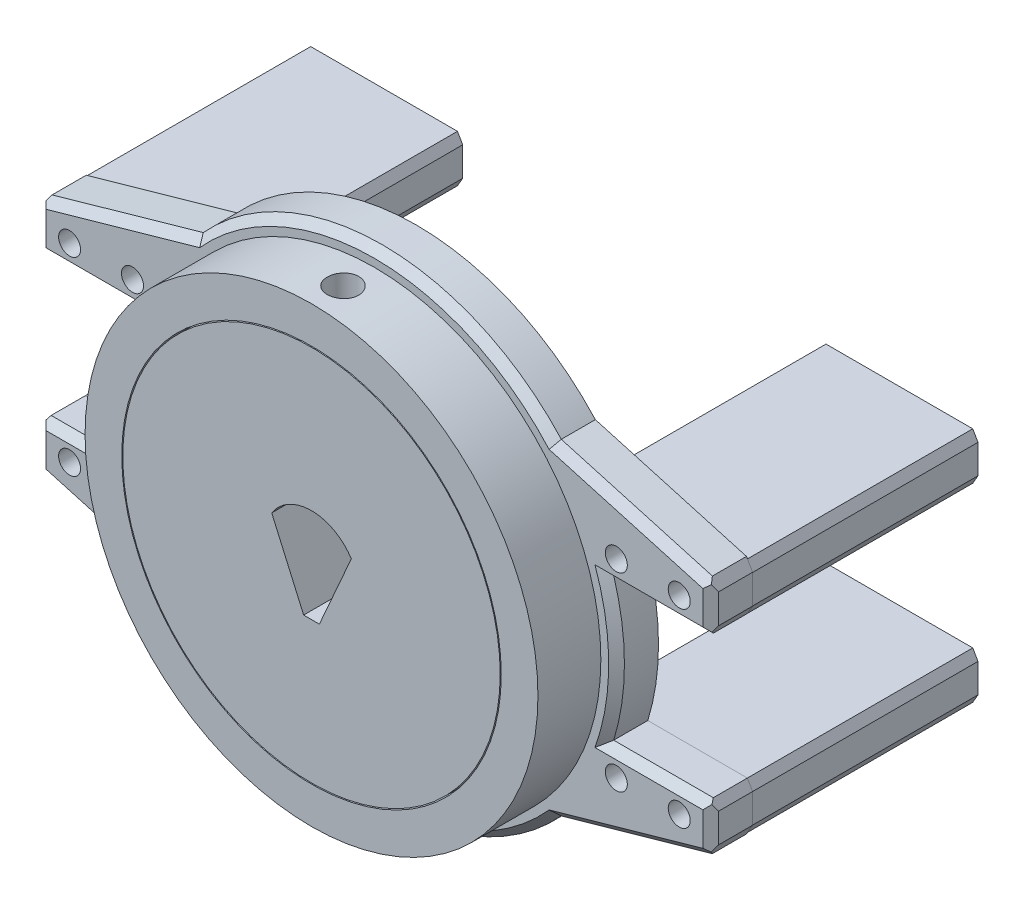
from build123d import *
from OCP.BRepFilletAPI import BRepFilletAPI_MakeChamfer
from build123d.topology import SkipClean

# Parameters (mm, degrees)
SKETCH2_R               = 36
BOSS_EXTRUDE1_DEPTH     = 12
CUT_EXTRUDE1_REACH      = 54.307
CUT_EXTRUDE1_END_RADIUS = 36
SKETCH3_R               = 2.6
SKETCH4_R               = 43.2
SKETCH4_R_2             = 36.2
BOSS_EXTRUDE2_DEPTH     = 12
CUT_EXTRUDE2_REACH      = 64.261
CUT_EXTRUDE2_END_RADIUS = 43.2
SKETCH5_R               = 3
SKETCH6_R               = 32
BOSS_EXTRUDE3_DEPTH     = 8
CHAMFER1_SIZE           = 1.5
BOSS_EXTRUDE4_DEPTH     = 43
BOSS_EXTRUDE4_2_DEPTH   = 43
BOSS_EXTRUDE4_3_DEPTH   = 43
BOSS_EXTRUDE4_4_DEPTH   = 43
CHAMFER3_SIZE           = 1
CHAMFER3_SIZE2          = 1.732050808
CHAMFER4_SIZE           = 1.7
CHAMFER4_SIZE2          = 1.220147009
CHAMFER4_SIZE2_2        = 0.981495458
CHAMFER5_SIZE           = 1.7
CHAMFER5_SIZE2          = 1.220147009
CHAMFER6_SIZE           = 1.7
CHAMFER6_SIZE2          = 1.220147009
SKETCH8_R               = 2.1
CUT_EXTRUDE3_DEPTH      = 8
SKETCH9_R               = 1.65
CUT_EXTRUDE4_DEPTH      = 25


with BuildPart() as part:
    # Sketch2 → Boss-Extrude1 (new body)
    with BuildSketch(Plane.XY):
        Circle(SKETCH2_R)
        with BuildLine():
            Line((-7.591902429, 4.833530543), (-1.5, -9))
            Line((-1.5, -9), (1.5, -9))
            Line((1.5, -9), (7.591902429, 4.833530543))
            ThreePointArc((7.591902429, 4.833530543), (4.330024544, 7.889923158), (0, 9))
            ThreePointArc((0, 9), (-4.330024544, 7.889923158), (-7.591902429, 4.833530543))
        make_face(mode=Mode.SUBTRACT)
    extrude(amount=BOSS_EXTRUDE1_DEPTH)

    # Cut-Extrude1: up to this cylinder (the profile starts inside it)
    with SkipClean():  # the faces are left unmerged after this step: merging them gives an invalid solid
        cut_extrude1_end = Plane(origin=(0, 0, 6), z_dir=(0, 0, -1)) * Cylinder(CUT_EXTRUDE1_END_RADIUS, 181.614, mode=Mode.PRIVATE)
        # Sketch3 → Cut-Extrude1 (cut, up to the surface)
        with BuildSketch(Plane(origin=(0, 0, 0), x_dir=(1, 0, 0), z_dir=(0, 1, 0)), mode=Mode.PRIVATE) as cut_extrude1_sk1:
            with Locations(Location((0, -6, 0), (0, 0, 90))):
                Circle(SKETCH3_R)
        cut_extrude1_tool1 = extrude(cut_extrude1_sk1.sketch, amount=CUT_EXTRUDE1_REACH, mode=Mode.PRIVATE) & cut_extrude1_end
        add(cut_extrude1_tool1.solids().sort_by_distance((0, 0, 6))[0], mode=Mode.SUBTRACT)


with BuildPart() as body_2:
    # Sketch4 → Boss-Extrude2 (new body)
    with BuildSketch(Plane(origin=(0, 0, 0), x_dir=(-1, 0, 0), z_dir=(0, 0, -1))):
        Circle(SKETCH4_R)
        Circle(SKETCH4_R_2, mode=Mode.SUBTRACT)
    extrude(amount=-BOSS_EXTRUDE2_DEPTH)

    # Cut-Extrude2: up to this cylinder (the profile starts inside it)
    cut_extrude2_end = Plane(origin=(0, 0, 6), z_dir=(0, 0, -1)) * Cylinder(CUT_EXTRUDE2_END_RADIUS, 215.922, mode=Mode.PRIVATE)
    # Sketch5 → Cut-Extrude2 (cut, up to the surface)
    with BuildSketch(Plane(origin=(0, 0, 0), x_dir=(1, 0, 0), z_dir=(0, 1, 0)), mode=Mode.PRIVATE) as cut_extrude2_sk1:
        with Locations(Location((0, -6, 0), (0, 0, 90))):
            Circle(SKETCH5_R)
    cut_extrude2_tool1 = extrude(cut_extrude2_sk1.sketch, amount=CUT_EXTRUDE2_REACH, mode=Mode.PRIVATE) & cut_extrude2_end
    add(cut_extrude2_tool1.solids().sort_by_distance((0, 0, 6))[0], mode=Mode.SUBTRACT)

    # Sketch6 → Boss-Extrude3 (add)
    with BuildSketch(Plane(origin=(0, 0, 0), x_dir=(-1, 0, 0), z_dir=(0, 0, -1))):
        with BuildLine():
            Line((44.152916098, -13.6), (64.152916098, -13.6))
            Line((64.152916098, -13.6), (64.152916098, -22.6))
            Line((64.152916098, -22.6), (34.152916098, -31.112992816))
            ThreePointArc((34.152916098, -31.112992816), (0, -46.2), (-34.152916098, -31.112992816))
            Line((-34.152916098, -31.112992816), (-64.152916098, -22.6))
            Line((-64.152916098, -22.6), (-64.152916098, -13.6))
            Line((-64.152916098, -13.6), (-44.152916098, -13.6))
            ThreePointArc((-44.152916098, -13.6), (-46.2, 0), (-44.152916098, 13.6))
            Line((-44.152916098, 13.6), (-64.152916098, 13.6))
            Line((-64.152916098, 13.6), (-64.152916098, 22.6))
            Line((-64.152916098, 22.6), (-34.152916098, 31.112992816))
            ThreePointArc((-34.152916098, 31.112992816), (0, 46.2), (34.152916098, 31.112992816))
            Line((34.152916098, 31.112992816), (64.152916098, 22.6))
            Line((64.152916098, 22.6), (64.152916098, 13.6))
            Line((64.152916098, 13.6), (44.152916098, 13.6))
            ThreePointArc((44.152916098, 13.6), (46.2, 0), (44.152916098, -13.6))
        make_face()
        Circle(SKETCH6_R, mode=Mode.SUBTRACT)
    extrude(amount=BOSS_EXTRUDE3_DEPTH)

    # Chamfer1
    chamfer1_edges = [body_2.edges().sort_by_distance(p)[0] for p in [
        (-64.152916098, 18.1, 0),
        (-49.152916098, 26.856496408, 0),
        (0, 46.2, 0),
        (49.152916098, 26.856496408, 0),
        (64.152916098, 18.1, 0),
        (54.152916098, 13.6, 0),
        (46.2, 0, 0),
        (54.152916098, -13.6, 0),
        (64.152916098, -18.1, 0),
        (49.152916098, -26.856496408, 0),
        (0, -46.2, 0),
        (-49.152916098, -26.856496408, 0),
        (-64.152916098, -18.1, 0),
        (-54.152916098, -13.6, 0),
        (-46.2, 0, 0),
        (-54.152916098, 13.6, 0),
    ]]
    chamfer(chamfer1_edges, length=CHAMFER1_SIZE)

    # Chamfer3: one chamfer whose edges measure the first distance from different faces: ONE call of the kernel's chamfer builder (chamfer() names one face for all edges)
    chamfer3_edges_1 = [body_2.edges().sort_by_distance(p)[0] for p in [
        (-64.152916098, 13.6, -4.75),
    ]]
    chamfer3_side_1 = [body_2.faces().sort_by_distance(p)[0] for p in [
        (-54.152916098, 13.6, -4.75),
    ]]
    chamfer3_edges_2 = [body_2.edges().sort_by_distance(p)[0] for p in [
        (64.152916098, -13.6, -4.75),
    ]]
    chamfer3_side_2 = [body_2.faces().sort_by_distance(p)[0] for p in [
        (54.152916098, -13.6, -4.75),
    ]]
    chamfer3 = BRepFilletAPI_MakeChamfer(body_2.part.solid().wrapped)
    for e in chamfer3_edges_1:
        chamfer3.Add(CHAMFER3_SIZE, CHAMFER3_SIZE2, e.wrapped, chamfer3_side_1[0].wrapped)  # the first distance lies on this face
    for e in chamfer3_edges_2:
        chamfer3.Add(CHAMFER3_SIZE, CHAMFER3_SIZE2, e.wrapped, chamfer3_side_2[0].wrapped)  # the first distance lies on this face
    add(Compound.cast(chamfer3.Shape()), mode=Mode.REPLACE)

    # Chamfer4: one chamfer whose edges measure the first distance from different faces: ONE call of the kernel's chamfer builder (chamfer() names one face for all edges)
    chamfer4_edges_1 = [body_2.edges().sort_by_distance(p)[0] for p in [
        (-64.152916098, 22.6, -4.75),
    ]]
    chamfer4_side_1 = [body_2.faces().sort_by_distance(p)[0] for p in [
        (-64.152916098, 18.966025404, -4.75),
    ]]
    chamfer4_edges_2 = [body_2.edges().sort_by_distance(p)[0] for p in [
        (64.152916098, 13.6, -4.75),
    ]]
    chamfer4_side_2 = [body_2.faces().sort_by_distance(p)[0] for p in [
        (64.152916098, 18.1, -4.75),
    ]]
    chamfer4_edges_3 = [body_2.edges().sort_by_distance(p)[0] for p in [
        (64.152916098, -22.6, -4.75),
    ]]
    chamfer4_side_3 = [body_2.faces().sort_by_distance(p)[0] for p in [
        (64.152916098, -18.966025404, -4.75),
    ]]
    chamfer4_edges_4 = [body_2.edges().sort_by_distance(p)[0] for p in [
        (-64.152916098, -13.6, -4.75),
    ]]
    chamfer4_side_4 = [body_2.faces().sort_by_distance(p)[0] for p in [
        (-64.152916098, -18.1, -4.75),
    ]]
    chamfer4 = BRepFilletAPI_MakeChamfer(body_2.part.solid().wrapped)
    for e in chamfer4_edges_1:
        chamfer4.Add(CHAMFER4_SIZE, CHAMFER4_SIZE2, e.wrapped, chamfer4_side_1[0].wrapped)  # the first distance lies on this face
    for e in chamfer4_edges_2:
        chamfer4.Add(CHAMFER4_SIZE, CHAMFER4_SIZE2_2, e.wrapped, chamfer4_side_2[0].wrapped)  # the first distance lies on this face
    for e in chamfer4_edges_3:
        chamfer4.Add(CHAMFER4_SIZE, CHAMFER4_SIZE2, e.wrapped, chamfer4_side_3[0].wrapped)  # the first distance lies on this face
    for e in chamfer4_edges_4:
        chamfer4.Add(CHAMFER4_SIZE, CHAMFER4_SIZE2_2, e.wrapped, chamfer4_side_4[0].wrapped)  # the first distance lies on this face
    add(Compound.cast(chamfer4.Shape()), mode=Mode.REPLACE)

    # Chamfer5
    chamfer5_edges = [body_2.edges().sort_by_distance(p)[0] for p in [
        (-64.152916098, -22.6, -4.75),
    ]]
    chamfer5_side = [body_2.faces().sort_by_distance(p)[0] for p in [
        (-64.152916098, -18.95, -4.75),
    ]]
    chamfer(chamfer5_edges, length=CHAMFER5_SIZE, length2=CHAMFER5_SIZE2, reference=chamfer5_side[0])

    # Chamfer6
    chamfer6_edges = [body_2.edges().sort_by_distance(p)[0] for p in [
        (64.152916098, 22.6, -4.75),
    ]]
    chamfer6_side = [body_2.faces().sort_by_distance(p)[0] for p in [
        (64.152916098, 18.95, -4.75),
    ]]
    chamfer(chamfer6_edges, length=CHAMFER6_SIZE, length2=CHAMFER6_SIZE2, reference=chamfer6_side[0])

    # Sketch8 → Cut-Extrude3 (cut)
    with BuildSketch(Plane(origin=(0, 0, -8), x_dir=(-1, 0, 0), z_dir=(0, 0, -1))):
        with Locations((46.152916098, -18.1)):
            Circle(SKETCH8_R)
        with Locations((46.152916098, 18.1)):
            Circle(SKETCH8_R)
        with Locations((-46.152916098, -18.1)):
            Circle(SKETCH8_R)
        with Locations((-46.152916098, 18.1)):
            Circle(SKETCH8_R)
        with Locations((-58.152916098, 18.1)):
            Circle(SKETCH8_R)
        with Locations((-58.152916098, -18.1)):
            Circle(SKETCH8_R)
        with Locations((58.152916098, -18.1)):
            Circle(SKETCH8_R)
        with Locations((58.152916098, 18.1)):
            Circle(SKETCH8_R)
    extrude(amount=-CUT_EXTRUDE3_DEPTH, mode=Mode.SUBTRACT)


with BuildPart() as body_3:
    # Sketch7 → Boss-Extrude4 (new body)
    with BuildSketch(Plane(origin=(0, 0, -8), x_dir=(-1, 0, 0), z_dir=(0, 0, -1))):
        Polygon((-63.152916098, 22.6), (-35.152916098, 22.6), (-34.152916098, 20.867949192), (-34.152916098, 15.332050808), (-35.152916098, 13.6), (-63.152916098, 13.6), (-64.152916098, 15.332050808), (-64.152916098, 20.867949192), align=None)
    extrude(amount=BOSS_EXTRUDE4_DEPTH)


with BuildPart() as body_4:
    # Sketch7 → Boss-Extrude4 2 (new body)
    with BuildSketch(Plane(origin=(0, 0, -8), x_dir=(-1, 0, 0), z_dir=(0, 0, -1))):
        Polygon((35.152916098, 13.6), (34.152916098, 15.332050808), (34.152916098, 20.867949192), (35.152916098, 22.6), (63.152916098, 22.6), (64.152916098, 20.867949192), (64.152916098, 15.332050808), (63.152916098, 13.6), align=None)
    extrude(amount=BOSS_EXTRUDE4_2_DEPTH)


with BuildPart() as body_5:
    # Sketch7 → Boss-Extrude4 3 (new body)
    with BuildSketch(Plane(origin=(0, 0, -8), x_dir=(-1, 0, 0), z_dir=(0, 0, -1))):
        Polygon((-64.152916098, -20.867949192), (-63.152916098, -22.6), (-35.152916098, -22.6), (-34.152916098, -20.867949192), (-34.152916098, -15.332050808), (-35.152916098, -13.6), (-63.152916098, -13.6), (-64.152916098, -15.332050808), align=None)
    extrude(amount=BOSS_EXTRUDE4_3_DEPTH)


with BuildPart() as body_6:
    # Sketch7 → Boss-Extrude4 4 (new body)
    with BuildSketch(Plane(origin=(0, 0, -8), x_dir=(-1, 0, 0), z_dir=(0, 0, -1))):
        Polygon((64.152916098, -20.867949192), (64.152916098, -15.332050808), (63.152916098, -13.6), (35.152916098, -13.6), (34.152916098, -15.332050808), (34.152916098, -20.867949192), (35.152916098, -22.6), (63.152916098, -22.6), align=None)
    extrude(amount=BOSS_EXTRUDE4_4_DEPTH)


with BuildPart() as cut_extrude4_tool:
    # Sketch9 → Cut-Extrude4 (new body)
    with BuildSketch(Plane.XY.offset(-8)):
        with Locations((58.152916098, -18.1)):
            Circle(SKETCH9_R)
        with Locations((58.152916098, 18.1)):
            Circle(SKETCH9_R)
        with Locations((46.152916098, 18.1)):
            Circle(SKETCH9_R)
        with Locations((46.152916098, -18.1)):
            Circle(SKETCH9_R)
        with Locations((-46.152916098, 18.1)):
            Circle(SKETCH9_R)
        with Locations((-58.152916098, 18.1)):
            Circle(SKETCH9_R)
        with Locations((-58.152916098, -18.1)):
            Circle(SKETCH9_R)
        with Locations((-46.152916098, -18.1)):
            Circle(SKETCH9_R)
    extrude(amount=-CUT_EXTRUDE4_DEPTH)


with BuildPart() as body_3_1:
    add(body_3.part)

    # Cut-Extrude4: cut by cut_extrude4_tool
    add(cut_extrude4_tool.part, mode=Mode.SUBTRACT)


with BuildPart() as body_4_1:
    add(body_4.part)

    # Cut-Extrude4: cut by cut_extrude4_tool
    add(cut_extrude4_tool.part, mode=Mode.SUBTRACT)


with BuildPart() as body_5_1:
    add(body_5.part)

    # Cut-Extrude4: cut by cut_extrude4_tool
    add(cut_extrude4_tool.part, mode=Mode.SUBTRACT)


with BuildPart() as body_6_1:
    add(body_6.part)

    # Cut-Extrude4: cut by cut_extrude4_tool
    add(cut_extrude4_tool.part, mode=Mode.SUBTRACT)


solid = Compound([part.part, body_2.part, body_3_1.part, body_4_1.part, body_5_1.part, body_6_1.part])
